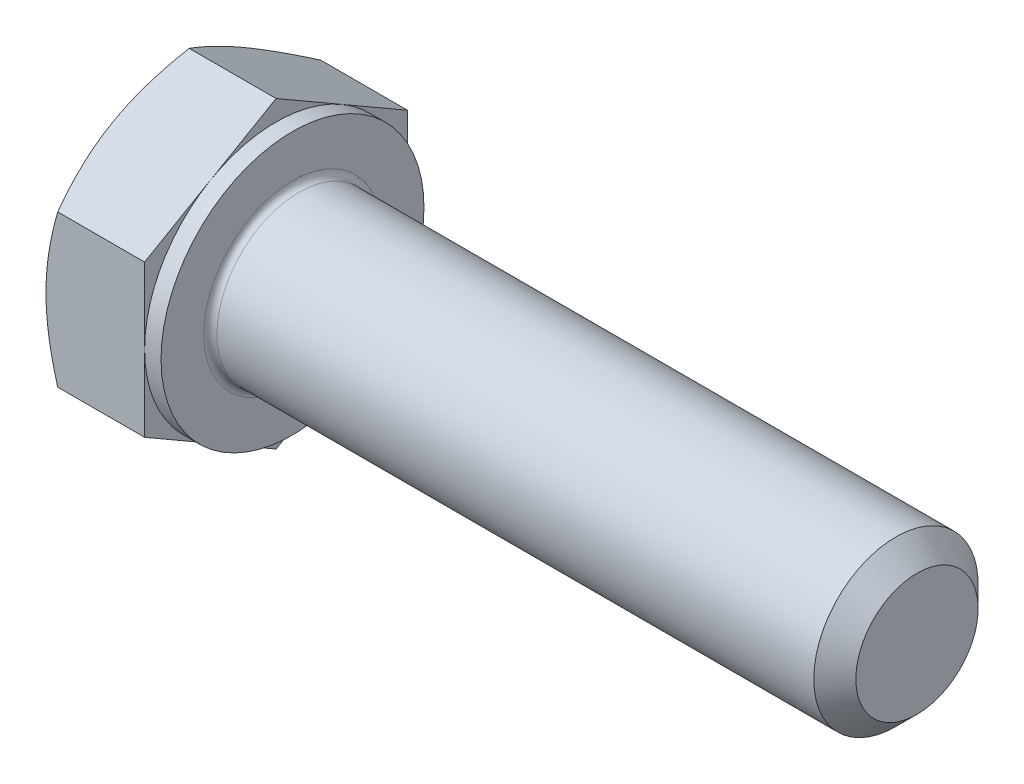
ISO-10303-21;
HEADER;
FILE_DESCRIPTION(('STEP AP214'),'2;1');
FILE_NAME('part.step','',(''),(''),'','','');
FILE_SCHEMA(('AUTOMOTIVE_DESIGN { 1 0 10303 214 1 1 1 1 }'));
ENDSEC;
DATA;
#1=APPLICATION_CONTEXT('core data for automotive mechanical design processes');
#2=APPLICATION_PROTOCOL_DEFINITION('international standard','automotive_design',2000,#1);
#3=PRODUCT_CONTEXT('',#1,'mechanical');
#4=PRODUCT('Part','Part','',(#3));
#5=PRODUCT_RELATED_PRODUCT_CATEGORY('part','',(#4));
#6=PRODUCT_DEFINITION_FORMATION('','',#4);
#7=PRODUCT_DEFINITION_CONTEXT('part definition',#1,'design');
#8=PRODUCT_DEFINITION('design','',#6,#7);
#9=PRODUCT_DEFINITION_SHAPE('','',#8);
#10=(LENGTH_UNIT() NAMED_UNIT(*) SI_UNIT(.MILLI.,.METRE.));
#11=(NAMED_UNIT(*) PLANE_ANGLE_UNIT() SI_UNIT($,.RADIAN.));
#12=(NAMED_UNIT(*) SI_UNIT($,.STERADIAN.) SOLID_ANGLE_UNIT());
#13=UNCERTAINTY_MEASURE_WITH_UNIT(LENGTH_MEASURE(1.E-05),#10,'distance_accuracy_value','');
#14=(GEOMETRIC_REPRESENTATION_CONTEXT(3) GLOBAL_UNCERTAINTY_ASSIGNED_CONTEXT((#13)) GLOBAL_UNIT_ASSIGNED_CONTEXT((#10,
#11,#12)) REPRESENTATION_CONTEXT('',''));
#15=CARTESIAN_POINT('',(0.,0.,0.));
#16=DIRECTION('',(0.,0.,1.));
#17=DIRECTION('',(1.,0.,0.));
#18=AXIS2_PLACEMENT_3D('',#15,#16,#17);
#19=CARTESIAN_POINT('',(3.5,2.3094010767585,-4.));
#20=DIRECTION('',(0.,-0.866025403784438,0.500000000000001));
#21=DIRECTION('',(0.,-0.500000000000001,-0.866025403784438));
#22=AXIS2_PLACEMENT_3D('',#19,#20,#21);
#23=PLANE('',#22);
#24=DIRECTION('',(0.,0.500000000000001,0.866025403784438));
#25=VECTOR('',#24,1.);
#26=CARTESIAN_POINT('',(3.,2.3094010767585,-4.));
#27=LINE('',#26,#25);
#28=CARTESIAN_POINT('',(3.,2.3094010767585,-4.));
#29=VERTEX_POINT('',#28);
#30=CARTESIAN_POINT('',(3.,3.46410161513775,-2.));
#31=VERTEX_POINT('',#30);
#32=EDGE_CURVE('E171',#29,#31,#27,.T.);
#33=ORIENTED_EDGE('',*,*,#32,.F.);
#34=DIRECTION('',(-1.,0.,0.));
#35=VECTOR('',#34,1.);
#36=CARTESIAN_POINT('',(3.5,2.3094010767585,-4.));
#37=LINE('',#36,#35);
#38=CARTESIAN_POINT('',(0.357265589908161,2.3094010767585,-4.));
#39=VERTEX_POINT('',#38);
#40=EDGE_CURVE('E299',#29,#39,#37,.T.);
#41=ORIENTED_EDGE('',*,*,#40,.T.);
#42=CARTESIAN_POINT('',(0.357332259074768,4.61891762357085,0.0002));
#43=CARTESIAN_POINT('',(0.298717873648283,4.51743148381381,-0.175579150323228));
#44=CARTESIAN_POINT('',(0.245410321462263,4.41506932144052,-0.35287561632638));
#45=CARTESIAN_POINT('',(0.152361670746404,4.2085725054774,-0.710538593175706));
#46=CARTESIAN_POINT('',(0.112653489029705,4.10443418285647,-0.890911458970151));
#47=CARTESIAN_POINT('',(0.05084221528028,3.89744813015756,-1.24942181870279));
#48=CARTESIAN_POINT('',(0.0283277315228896,3.7946322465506,-1.42750415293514));
#49=CARTESIAN_POINT('',(0.00145062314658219,3.58851671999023,-1.78450671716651));
#50=CARTESIAN_POINT('',(-0.0029342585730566,3.48521782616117,-1.9634256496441));
#51=CARTESIAN_POINT('',(0.00619007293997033,3.29219970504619,-2.29774284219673));
#52=CARTESIAN_POINT('',(0.0174589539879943,3.20245157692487,-2.45319115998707));
#53=CARTESIAN_POINT('',(0.053173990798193,3.02354002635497,-2.76307505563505));
#54=CARTESIAN_POINT('',(0.0776323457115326,2.93437722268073,-2.91750956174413));
#55=CARTESIAN_POINT('',(0.138776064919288,2.75509682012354,-3.22803232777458));
#56=CARTESIAN_POINT('',(0.175720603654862,2.6650019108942,-3.3840812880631));
#57=CARTESIAN_POINT('',(0.259570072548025,2.48615580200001,-3.69385183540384));
#58=CARTESIAN_POINT('',(0.306455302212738,2.39740231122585,-3.84757739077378));
#59=CARTESIAN_POINT('',(0.357332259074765,2.30928560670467,-4.0002));
#60=B_SPLINE_CURVE_WITH_KNOTS('',3,(#42,#43,#44,#45,#46,#47,#48,#49,#50,#51,#52,#53,#54,#55,#56,
#57,#58,#59),.UNSPECIFIED.,.F.,.F.,(4,2,2,2,2,2,2,2,4),(0.,0.634047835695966,1.26961969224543,
1.88946157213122,2.50854226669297,3.04757825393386,3.58711366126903,4.13861653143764,
4.68903648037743),.UNSPECIFIED.);
#61=CARTESIAN_POINT('',(0.,3.46410161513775,-2.));
#62=VERTEX_POINT('',#61);
#63=EDGE_CURVE('E226',#62,#39,#60,.T.);
#64=ORIENTED_EDGE('',*,*,#63,.F.);
#65=CARTESIAN_POINT('',(0.357265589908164,4.61880215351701,0.));
#66=VERTEX_POINT('',#65);
#67=EDGE_CURVE('E62',#66,#62,#60,.T.);
#68=ORIENTED_EDGE('',*,*,#67,.F.);
#69=DIRECTION('',(-1.,0.,0.));
#70=VECTOR('',#69,1.);
#71=CARTESIAN_POINT('',(3.5,4.61880215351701,0.));
#72=LINE('',#71,#70);
#73=CARTESIAN_POINT('',(3.,4.61880215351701,0.));
#74=VERTEX_POINT('',#73);
#75=EDGE_CURVE('E291',#74,#66,#72,.T.);
#76=ORIENTED_EDGE('',*,*,#75,.F.);
#77=EDGE_CURVE('E169',#31,#74,#27,.T.);
#78=ORIENTED_EDGE('',*,*,#77,.F.);
#79=EDGE_LOOP('',(#33,#41,#64,#68,#76,#78));
#80=FACE_BOUND('',#79,.T.);
#81=ADVANCED_FACE('F39',(#80),#23,.F.);
#82=CARTESIAN_POINT('',(3.5,4.61880215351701,0.));
#83=DIRECTION('',(0.,-0.866025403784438,-0.500000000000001));
#84=DIRECTION('',(0.,0.500000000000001,-0.866025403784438));
#85=AXIS2_PLACEMENT_3D('',#82,#83,#84);
#86=PLANE('',#85);
#87=DIRECTION('',(0.,-0.500000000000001,0.866025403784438));
#88=VECTOR('',#87,1.);
#89=CARTESIAN_POINT('',(3.,4.61880215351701,0.));
#90=LINE('',#89,#88);
#91=CARTESIAN_POINT('',(3.,3.46410161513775,2.));
#92=VERTEX_POINT('',#91);
#93=EDGE_CURVE('E168',#74,#92,#90,.T.);
#94=ORIENTED_EDGE('',*,*,#93,.F.);
#95=ORIENTED_EDGE('',*,*,#75,.T.);
#96=CARTESIAN_POINT('',(0.357332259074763,2.30928560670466,4.0002));
#97=CARTESIAN_POINT('',(0.298717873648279,2.4107717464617,3.82442084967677));
#98=CARTESIAN_POINT('',(0.24541032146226,2.51313390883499,3.64712438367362));
#99=CARTESIAN_POINT('',(0.152361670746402,2.71963072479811,3.28946140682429));
#100=CARTESIAN_POINT('',(0.112653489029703,2.82376904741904,3.10908854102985));
#101=CARTESIAN_POINT('',(0.0508422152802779,3.03075510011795,2.75057818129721));
#102=CARTESIAN_POINT('',(0.0283277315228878,3.13357098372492,2.57249584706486));
#103=CARTESIAN_POINT('',(0.00145062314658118,3.33968651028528,2.21549328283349));
#104=CARTESIAN_POINT('',(-0.00293425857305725,3.44298540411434,2.0365743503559));
#105=CARTESIAN_POINT('',(0.0061900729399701,3.63600352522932,1.70225715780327));
#106=CARTESIAN_POINT('',(0.0174589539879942,3.72575165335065,1.54680884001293));
#107=CARTESIAN_POINT('',(0.0531739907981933,3.90466320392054,1.23692494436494));
#108=CARTESIAN_POINT('',(0.0776323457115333,3.99382600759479,1.08249043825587));
#109=CARTESIAN_POINT('',(0.13877606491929,4.17310641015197,0.771967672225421));
#110=CARTESIAN_POINT('',(0.175720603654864,4.26320131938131,0.615918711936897));
#111=CARTESIAN_POINT('',(0.259570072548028,4.44204742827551,0.30614816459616));
#112=CARTESIAN_POINT('',(0.306455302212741,4.53080091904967,0.15242260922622));
#113=CARTESIAN_POINT('',(0.357332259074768,4.61891762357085,-0.000200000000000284));
#114=B_SPLINE_CURVE_WITH_KNOTS('',3,(#96,#97,#98,#99,#100,#101,#102,#103,#104,#105,#106,#107,
#108,#109,#110,#111,#112,#113),.UNSPECIFIED.,.F.,.F.,(4,2,2,2,2,2,2,2,4),(0.,0.634047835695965,
1.26961969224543,1.88946157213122,2.50854226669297,3.04757825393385,3.58711366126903,
4.13861653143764,4.68903648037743),.UNSPECIFIED.);
#115=CARTESIAN_POINT('',(0.,3.46410161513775,2.));
#116=VERTEX_POINT('',#115);
#117=EDGE_CURVE('E223',#116,#66,#114,.T.);
#118=ORIENTED_EDGE('',*,*,#117,.F.);
#119=CARTESIAN_POINT('',(0.35726558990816,2.3094010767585,4.));
#120=VERTEX_POINT('',#119);
#121=EDGE_CURVE('E237',#120,#116,#114,.T.);
#122=ORIENTED_EDGE('',*,*,#121,.F.);
#123=DIRECTION('',(-1.,0.,0.));
#124=VECTOR('',#123,1.);
#125=CARTESIAN_POINT('',(3.5,2.3094010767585,4.));
#126=LINE('',#125,#124);
#127=CARTESIAN_POINT('',(3.,2.3094010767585,4.));
#128=VERTEX_POINT('',#127);
#129=EDGE_CURVE('E293',#128,#120,#126,.T.);
#130=ORIENTED_EDGE('',*,*,#129,.F.);
#131=EDGE_CURVE('E136',#92,#128,#90,.T.);
#132=ORIENTED_EDGE('',*,*,#131,.F.);
#133=EDGE_LOOP('',(#94,#95,#118,#122,#130,#132));
#134=FACE_BOUND('',#133,.T.);
#135=ADVANCED_FACE('F244',(#134),#86,.F.);
#136=CARTESIAN_POINT('',(3.5,2.3094010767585,4.));
#137=DIRECTION('',(0.,0.,-1.));
#138=DIRECTION('',(0.,1.,0.));
#139=AXIS2_PLACEMENT_3D('',#136,#137,#138);
#140=PLANE('',#139);
#141=DIRECTION('',(0.,-1.,0.));
#142=VECTOR('',#141,1.);
#143=CARTESIAN_POINT('',(3.,2.3094010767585,4.));
#144=LINE('',#143,#142);
#145=CARTESIAN_POINT('',(3.,0.,4.));
#146=VERTEX_POINT('',#145);
#147=EDGE_CURVE('E130',#128,#146,#144,.T.);
#148=ORIENTED_EDGE('',*,*,#147,.F.);
#149=ORIENTED_EDGE('',*,*,#129,.T.);
#150=CARTESIAN_POINT('',(2.00011120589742,-6.30203842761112,4.));
#151=CARTESIAN_POINT('',(1.91454696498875,-6.12645846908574,4.));
#152=CARTESIAN_POINT('',(1.82977515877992,-5.95048585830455,4.));
#153=CARTESIAN_POINT('',(1.66226027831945,-5.59754684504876,4.));
#154=CARTESIAN_POINT('',(1.57951750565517,-5.42058029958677,4.));
#155=CARTESIAN_POINT('',(1.41610926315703,-5.06457985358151,4.));
#156=CARTESIAN_POINT('',(1.33545672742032,-4.88553999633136,4.));
#157=CARTESIAN_POINT('',(1.17732358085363,-4.52607013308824,4.));
#158=CARTESIAN_POINT('',(1.09984282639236,-4.34564019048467,4.));
#159=CARTESIAN_POINT('',(0.946328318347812,-3.97695712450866,4.));
#160=CARTESIAN_POINT('',(0.870432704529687,-3.7886461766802,4.));
#161=CARTESIAN_POINT('',(0.724150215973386,-3.40985798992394,4.));
#162=CARTESIAN_POINT('',(0.653763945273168,-3.21938051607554,4.));
#163=CARTESIAN_POINT('',(0.52027562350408,-2.83628177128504,4.));
#164=CARTESIAN_POINT('',(0.457159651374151,-2.64366539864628,4.));
#165=CARTESIAN_POINT('',(0.340171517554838,-2.25567134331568,4.));
#166=CARTESIAN_POINT('',(0.286296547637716,-2.06029451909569,4.));
#167=CARTESIAN_POINT('',(0.190596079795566,-1.66775019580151,4.));
#168=CARTESIAN_POINT('',(0.148703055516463,-1.47059946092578,4.));
#169=CARTESIAN_POINT('',(0.0792701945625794,-1.07374632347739,4.));
#170=CARTESIAN_POINT('',(0.0517287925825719,-0.874044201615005,4.));
#171=CARTESIAN_POINT('',(0.0135517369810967,-0.475733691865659,4.));
#172=CARTESIAN_POINT('',(0.00269106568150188,-0.277147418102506,4.));
#173=CARTESIAN_POINT('',(-0.0018027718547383,0.120241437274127,4.));
#174=CARTESIAN_POINT('',(0.00456430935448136,0.31904402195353,4.));
#175=CARTESIAN_POINT('',(0.029319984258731,0.653649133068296,4.));
#176=CARTESIAN_POINT('',(0.0433487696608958,0.789796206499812,4.));
#177=CARTESIAN_POINT('',(0.0786650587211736,1.0611517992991,4.));
#178=CARTESIAN_POINT('',(0.0999534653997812,1.1963601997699,4.));
#179=CARTESIAN_POINT('',(0.173595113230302,1.6003610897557,4.));
#180=CARTESIAN_POINT('',(0.235713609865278,1.86739658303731,4.));
#181=CARTESIAN_POINT('',(0.344187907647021,2.26690842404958,4.));
#182=CARTESIAN_POINT('',(0.383434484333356,2.40143348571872,4.));
#183=CARTESIAN_POINT('',(0.466191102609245,2.66917849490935,4.));
#184=CARTESIAN_POINT('',(0.509701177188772,2.8023984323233,4.));
#185=CARTESIAN_POINT('',(0.600271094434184,3.06757339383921,4.));
#186=CARTESIAN_POINT('',(0.647329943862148,3.19952876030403,4.));
#187=CARTESIAN_POINT('',(0.744425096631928,3.46233234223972,4.));
#188=CARTESIAN_POINT('',(0.794461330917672,3.5931805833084,4.));
#189=CARTESIAN_POINT('',(0.933355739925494,3.9462730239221,4.));
#190=CARTESIAN_POINT('',(1.0245987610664,4.16757823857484,4.));
#191=CARTESIAN_POINT('',(1.21247228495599,4.6078984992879,4.));
#192=CARTESIAN_POINT('',(1.30910339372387,4.82691328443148,4.));
#193=CARTESIAN_POINT('',(1.50647026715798,5.26317250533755,4.));
#194=CARTESIAN_POINT('',(1.60720747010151,5.48041628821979,4.));
#195=CARTESIAN_POINT('',(1.81181128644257,5.91342831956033,4.));
#196=CARTESIAN_POINT('',(1.91567799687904,6.12919652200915,3.99999999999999));
#197=CARTESIAN_POINT('',(2.12601769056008,6.55988022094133,3.99999999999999));
#198=CARTESIAN_POINT('',(2.23249454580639,6.77479382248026,3.99999999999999));
#199=CARTESIAN_POINT('',(2.44739203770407,7.20364803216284,3.99999999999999));
#200=CARTESIAN_POINT('',(2.55581269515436,7.41758862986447,3.99999999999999));
#201=CARTESIAN_POINT('',(2.88334503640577,8.05812603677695,3.99999999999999));
#202=CARTESIAN_POINT('',(3.10477549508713,8.48353660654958,3.99999999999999));
#203=CARTESIAN_POINT('',(3.52798949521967,9.28704830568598,3.99999999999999));
#204=CARTESIAN_POINT('',(3.72935795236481,9.66536913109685,3.99999999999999));
#205=CARTESIAN_POINT('',(4.13451859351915,10.4207405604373,3.99999999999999));
#206=CARTESIAN_POINT('',(4.33831092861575,10.7977910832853,3.99999999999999));
#207=CARTESIAN_POINT('',(4.74699525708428,11.5496417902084,3.99999999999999));
#208=CARTESIAN_POINT('',(4.95188119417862,11.9244452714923,3.99999999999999));
#209=CARTESIAN_POINT('',(5.36302659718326,12.6732594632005,3.99999999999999));
#210=CARTESIAN_POINT('',(5.56928595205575,13.0472702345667,3.99999999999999));
#211=CARTESIAN_POINT('',(5.7760450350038,13.42100281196,3.99999999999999));
#212=B_SPLINE_CURVE_WITH_KNOTS('',3,(#150,#151,#152,#153,#154,#155,#156,#157,#158,#159,#160,
#161,#162,#163,#164,#165,#166,#167,#168,#169,#170,#171,#172,#173,#174,#175,#176,#177,#178,#179,
#180,#181,#182,#183,#184,#185,#186,#187,#188,#189,#190,#191,#192,#193,#194,#195,#196,#197,#198,
#199,#200,#201,#202,#203,#204,#205,#206,#207,#208,#209,#210,#211),.UNSPECIFIED.,.F.,.F.,(4,2,2,
2,2,2,2,2,2,2,2,2,2,2,2,2,2,2,2,2,2,2,2,2,2,2,2,2,2,2,4),(0.,0.585964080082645,1.17201473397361,
1.76109183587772,2.35014223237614,2.95916537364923,3.56825519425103,4.17615863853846,
4.78387701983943,5.38809979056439,5.99225664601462,6.58818973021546,7.18413137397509,
7.59453803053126,8.00499575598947,8.82630884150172,9.24666973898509,9.66703388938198,
10.0872808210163,10.5075180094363,11.2255416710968,11.9436462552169,12.6620045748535,
13.3803851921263,14.0999050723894,14.8194326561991,16.2581595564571,17.5438734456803,
18.8296679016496,20.1111105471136,21.3924508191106),.UNSPECIFIED.);
#213=CARTESIAN_POINT('',(0.,0.,4.));
#214=VERTEX_POINT('',#213);
#215=EDGE_CURVE('E238',#214,#120,#212,.T.);
#216=ORIENTED_EDGE('',*,*,#215,.F.);
#217=CARTESIAN_POINT('',(0.357265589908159,-2.3094010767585,4.));
#218=VERTEX_POINT('',#217);
#219=EDGE_CURVE('E300',#218,#214,#212,.T.);
#220=ORIENTED_EDGE('',*,*,#219,.F.);
#221=DIRECTION('',(-1.,0.,0.));
#222=VECTOR('',#221,1.);
#223=CARTESIAN_POINT('',(3.5,-2.3094010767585,4.));
#224=LINE('',#223,#222);
#225=CARTESIAN_POINT('',(3.,-2.3094010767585,4.));
#226=VERTEX_POINT('',#225);
#227=EDGE_CURVE('E162',#226,#218,#224,.T.);
#228=ORIENTED_EDGE('',*,*,#227,.F.);
#229=EDGE_CURVE('E140',#146,#226,#144,.T.);
#230=ORIENTED_EDGE('',*,*,#229,.F.);
#231=EDGE_LOOP('',(#148,#149,#216,#220,#228,#230));
#232=FACE_BOUND('',#231,.T.);
#233=ADVANCED_FACE('F160',(#232),#140,.F.);
#234=CARTESIAN_POINT('',(3.5,-4.618802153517,0.));
#235=DIRECTION('',(0.,0.866025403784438,-0.500000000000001));
#236=DIRECTION('',(0.,0.500000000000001,0.866025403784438));
#237=AXIS2_PLACEMENT_3D('',#234,#235,#236);
#238=PLANE('',#237);
#239=DIRECTION('',(0.,-0.500000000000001,-0.866025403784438));
#240=VECTOR('',#239,1.);
#241=CARTESIAN_POINT('',(3.,-4.618802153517,0.));
#242=LINE('',#241,#240);
#243=CARTESIAN_POINT('',(3.,-3.46410161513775,2.));
#244=VERTEX_POINT('',#243);
#245=EDGE_CURVE('E147',#226,#244,#242,.T.);
#246=ORIENTED_EDGE('',*,*,#245,.F.);
#247=ORIENTED_EDGE('',*,*,#227,.T.);
#248=CARTESIAN_POINT('',(0.357332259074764,-4.61891762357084,-0.000199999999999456));
#249=CARTESIAN_POINT('',(0.29871787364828,-4.5174314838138,0.175579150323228));
#250=CARTESIAN_POINT('',(0.24541032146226,-4.41506932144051,0.352875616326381));
#251=CARTESIAN_POINT('',(0.152361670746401,-4.20857250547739,0.710538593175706));
#252=CARTESIAN_POINT('',(0.112653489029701,-4.10443418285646,0.890911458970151));
#253=CARTESIAN_POINT('',(0.0508422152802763,-3.89744813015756,1.24942181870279));
#254=CARTESIAN_POINT('',(0.0283277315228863,-3.79463224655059,1.42750415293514));
#255=CARTESIAN_POINT('',(0.00145062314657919,-3.58851671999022,1.78450671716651));
#256=CARTESIAN_POINT('',(-0.00293425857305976,-3.48521782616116,1.9634256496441));
#257=CARTESIAN_POINT('',(0.0061900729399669,-3.29219970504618,2.29774284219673));
#258=CARTESIAN_POINT('',(0.0174589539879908,-3.20245157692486,2.45319115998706));
#259=CARTESIAN_POINT('',(0.0531739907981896,-3.02354002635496,2.76307505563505));
#260=CARTESIAN_POINT('',(0.0776323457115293,-2.93437722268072,2.91750956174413));
#261=CARTESIAN_POINT('',(0.138776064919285,-2.75509682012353,3.22803232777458));
#262=CARTESIAN_POINT('',(0.17572060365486,-2.66500191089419,3.3840812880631));
#263=CARTESIAN_POINT('',(0.259570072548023,-2.486155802,3.69385183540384));
#264=CARTESIAN_POINT('',(0.306455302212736,-2.39740231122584,3.84757739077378));
#265=CARTESIAN_POINT('',(0.357332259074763,-2.30928560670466,4.0002));
#266=B_SPLINE_CURVE_WITH_KNOTS('',3,(#248,#249,#250,#251,#252,#253,#254,#255,#256,#257,#258,
#259,#260,#261,#262,#263,#264,#265),.UNSPECIFIED.,.F.,.F.,(4,2,2,2,2,2,2,2,4),(0.,
0.634047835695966,1.26961969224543,1.88946157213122,2.50854226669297,3.04757825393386,
3.58711366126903,4.13861653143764,4.68903648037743),.UNSPECIFIED.);
#267=CARTESIAN_POINT('',(0.,-3.46410161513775,2.));
#268=VERTEX_POINT('',#267);
#269=EDGE_CURVE('E225',#268,#218,#266,.T.);
#270=ORIENTED_EDGE('',*,*,#269,.F.);
#271=CARTESIAN_POINT('',(0.357265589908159,-4.618802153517,0.));
#272=VERTEX_POINT('',#271);
#273=EDGE_CURVE('E217',#272,#268,#266,.T.);
#274=ORIENTED_EDGE('',*,*,#273,.F.);
#275=DIRECTION('',(-1.,0.,0.));
#276=VECTOR('',#275,1.);
#277=CARTESIAN_POINT('',(3.5,-4.618802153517,0.));
#278=LINE('',#277,#276);
#279=CARTESIAN_POINT('',(3.,-4.618802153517,0.));
#280=VERTEX_POINT('',#279);
#281=EDGE_CURVE('E296',#280,#272,#278,.T.);
#282=ORIENTED_EDGE('',*,*,#281,.F.);
#283=EDGE_CURVE('E163',#244,#280,#242,.T.);
#284=ORIENTED_EDGE('',*,*,#283,.F.);
#285=EDGE_LOOP('',(#246,#247,#270,#274,#282,#284));
#286=FACE_BOUND('',#285,.T.);
#287=ADVANCED_FACE('F208',(#286),#238,.F.);
#288=CARTESIAN_POINT('',(3.5,-2.3094010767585,-4.));
#289=DIRECTION('',(0.,0.866025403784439,0.5));
#290=DIRECTION('',(0.,-0.5,0.866025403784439));
#291=AXIS2_PLACEMENT_3D('',#288,#289,#290);
#292=PLANE('',#291);
#293=DIRECTION('',(0.,0.5,-0.866025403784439));
#294=VECTOR('',#293,1.);
#295=CARTESIAN_POINT('',(3.,-2.3094010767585,-4.));
#296=LINE('',#295,#294);
#297=CARTESIAN_POINT('',(3.,-3.46410161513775,-2.));
#298=VERTEX_POINT('',#297);
#299=EDGE_CURVE('E346',#280,#298,#296,.T.);
#300=ORIENTED_EDGE('',*,*,#299,.F.);
#301=ORIENTED_EDGE('',*,*,#281,.T.);
#302=CARTESIAN_POINT('',(0.357332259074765,-2.30928560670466,-4.0002));
#303=CARTESIAN_POINT('',(0.298717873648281,-2.4107717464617,-3.82442084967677));
#304=CARTESIAN_POINT('',(0.245410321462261,-2.51313390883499,-3.64712438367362));
#305=CARTESIAN_POINT('',(0.152361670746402,-2.71963072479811,-3.28946140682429));
#306=CARTESIAN_POINT('',(0.112653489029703,-2.82376904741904,-3.10908854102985));
#307=CARTESIAN_POINT('',(0.0508422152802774,-3.03075510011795,-2.75057818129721));
#308=CARTESIAN_POINT('',(0.028327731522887,-3.13357098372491,-2.57249584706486));
#309=CARTESIAN_POINT('',(0.00145062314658,-3.33968651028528,-2.21549328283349));
#310=CARTESIAN_POINT('',(-0.00293425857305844,-3.44298540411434,-2.0365743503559));
#311=CARTESIAN_POINT('',(0.00619007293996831,-3.63600352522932,-1.70225715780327));
#312=CARTESIAN_POINT('',(0.0174589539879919,-3.72575165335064,-1.54680884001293));
#313=CARTESIAN_POINT('',(0.0531739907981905,-3.90466320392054,-1.23692494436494));
#314=CARTESIAN_POINT('',(0.0776323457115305,-3.99382600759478,-1.08249043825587));
#315=CARTESIAN_POINT('',(0.138776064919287,-4.17310641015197,-0.771967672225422));
#316=CARTESIAN_POINT('',(0.17572060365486,-4.26320131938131,-0.615918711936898));
#317=CARTESIAN_POINT('',(0.259570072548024,-4.4420474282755,-0.306148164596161));
#318=CARTESIAN_POINT('',(0.306455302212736,-4.53080091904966,-0.152422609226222));
#319=CARTESIAN_POINT('',(0.357332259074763,-4.61891762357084,0.000199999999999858));
#320=B_SPLINE_CURVE_WITH_KNOTS('',3,(#302,#303,#304,#305,#306,#307,#308,#309,#310,#311,#312,
#313,#314,#315,#316,#317,#318,#319),.UNSPECIFIED.,.F.,.F.,(4,2,2,2,2,2,2,2,4),(0.,
0.634047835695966,1.26961969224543,1.88946157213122,2.50854226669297,3.04757825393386,
3.58711366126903,4.13861653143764,4.68903648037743),.UNSPECIFIED.);
#321=CARTESIAN_POINT('',(0.,-3.46410161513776,-2.));
#322=VERTEX_POINT('',#321);
#323=EDGE_CURVE('E224',#322,#272,#320,.T.);
#324=ORIENTED_EDGE('',*,*,#323,.F.);
#325=CARTESIAN_POINT('',(0.357265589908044,-2.30940107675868,-4.));
#326=VERTEX_POINT('',#325);
#327=EDGE_CURVE('E185',#326,#322,#320,.T.);
#328=ORIENTED_EDGE('',*,*,#327,.F.);
#329=DIRECTION('',(-1.,0.,0.));
#330=VECTOR('',#329,1.);
#331=CARTESIAN_POINT('',(3.5,-2.3094010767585,-4.));
#332=LINE('',#331,#330);
#333=CARTESIAN_POINT('',(3.,-2.3094010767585,-4.));
#334=VERTEX_POINT('',#333);
#335=EDGE_CURVE('E298',#334,#326,#332,.T.);
#336=ORIENTED_EDGE('',*,*,#335,.F.);
#337=EDGE_CURVE('E158',#298,#334,#296,.T.);
#338=ORIENTED_EDGE('',*,*,#337,.F.);
#339=EDGE_LOOP('',(#300,#301,#324,#328,#336,#338));
#340=FACE_BOUND('',#339,.T.);
#341=ADVANCED_FACE('F201',(#340),#292,.F.);
#342=CARTESIAN_POINT('',(3.5,2.3094010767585,-4.));
#343=DIRECTION('',(0.,0.,1.));
#344=DIRECTION('',(0.,-1.,0.));
#345=AXIS2_PLACEMENT_3D('',#342,#343,#344);
#346=PLANE('',#345);
#347=DIRECTION('',(0.,1.,0.));
#348=VECTOR('',#347,1.);
#349=CARTESIAN_POINT('',(3.,2.3094010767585,-4.));
#350=LINE('',#349,#348);
#351=CARTESIAN_POINT('',(3.,0.,-4.));
#352=VERTEX_POINT('',#351);
#353=EDGE_CURVE('E270',#334,#352,#350,.T.);
#354=ORIENTED_EDGE('',*,*,#353,.F.);
#355=ORIENTED_EDGE('',*,*,#335,.T.);
#356=CARTESIAN_POINT('',(2.00011120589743,-6.30203842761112,-4.));
#357=CARTESIAN_POINT('',(1.91454696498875,-6.12645846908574,-4.));
#358=CARTESIAN_POINT('',(1.82977515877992,-5.95048585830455,-4.));
#359=CARTESIAN_POINT('',(1.66226027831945,-5.59754684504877,-4.));
#360=CARTESIAN_POINT('',(1.57951750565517,-5.42058029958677,-4.));
#361=CARTESIAN_POINT('',(1.41610926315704,-5.06457985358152,-4.));
#362=CARTESIAN_POINT('',(1.33545672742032,-4.88553999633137,-4.));
#363=CARTESIAN_POINT('',(1.17732358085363,-4.52607013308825,-4.));
#364=CARTESIAN_POINT('',(1.09984282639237,-4.34564019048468,-4.));
#365=CARTESIAN_POINT('',(0.946328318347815,-3.97695712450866,-4.));
#366=CARTESIAN_POINT('',(0.87043270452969,-3.78864617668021,-4.));
#367=CARTESIAN_POINT('',(0.724150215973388,-3.40985798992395,-4.));
#368=CARTESIAN_POINT('',(0.65376394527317,-3.21938051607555,-4.));
#369=CARTESIAN_POINT('',(0.520275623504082,-2.83628177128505,-4.));
#370=CARTESIAN_POINT('',(0.457159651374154,-2.64366539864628,-4.));
#371=CARTESIAN_POINT('',(0.34017151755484,-2.25567134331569,-4.));
#372=CARTESIAN_POINT('',(0.286296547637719,-2.0602945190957,-4.));
#373=CARTESIAN_POINT('',(0.190596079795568,-1.66775019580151,-4.));
#374=CARTESIAN_POINT('',(0.148703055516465,-1.47059946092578,-4.));
#375=CARTESIAN_POINT('',(0.0792701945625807,-1.07374632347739,-4.));
#376=CARTESIAN_POINT('',(0.051728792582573,-0.874044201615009,-4.));
#377=CARTESIAN_POINT('',(0.0135517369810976,-0.475733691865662,-4.));
#378=CARTESIAN_POINT('',(0.0026910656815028,-0.277147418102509,-4.));
#379=CARTESIAN_POINT('',(-0.0018027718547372,0.120241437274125,-4.));
#380=CARTESIAN_POINT('',(0.00456430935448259,0.319044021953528,-4.));
#381=CARTESIAN_POINT('',(0.0293199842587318,0.653649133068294,-4.));
#382=CARTESIAN_POINT('',(0.0433487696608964,0.78979620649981,-4.));
#383=CARTESIAN_POINT('',(0.078665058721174,1.06115179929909,-4.));
#384=CARTESIAN_POINT('',(0.0999534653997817,1.19636019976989,-4.));
#385=CARTESIAN_POINT('',(0.173595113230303,1.6003610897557,-4.));
#386=CARTESIAN_POINT('',(0.235713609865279,1.86739658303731,-4.));
#387=CARTESIAN_POINT('',(0.344187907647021,2.26690842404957,-4.));
#388=CARTESIAN_POINT('',(0.383434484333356,2.40143348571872,-4.));
#389=CARTESIAN_POINT('',(0.466191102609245,2.66917849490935,-4.));
#390=CARTESIAN_POINT('',(0.509701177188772,2.8023984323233,-4.));
#391=CARTESIAN_POINT('',(0.600271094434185,3.06757339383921,-4.));
#392=CARTESIAN_POINT('',(0.647329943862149,3.19952876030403,-4.));
#393=CARTESIAN_POINT('',(0.744425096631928,3.46233234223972,-4.));
#394=CARTESIAN_POINT('',(0.794461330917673,3.5931805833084,-4.));
#395=CARTESIAN_POINT('',(0.933355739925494,3.9462730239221,-4.));
#396=CARTESIAN_POINT('',(1.0245987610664,4.16757823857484,-4.));
#397=CARTESIAN_POINT('',(1.21247228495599,4.6078984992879,-4.));
#398=CARTESIAN_POINT('',(1.30910339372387,4.82691328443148,-4.));
#399=CARTESIAN_POINT('',(1.50647026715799,5.26317250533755,-4.));
#400=CARTESIAN_POINT('',(1.60720747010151,5.48041628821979,-4.));
#401=CARTESIAN_POINT('',(1.81181128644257,5.91342831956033,-4.));
#402=CARTESIAN_POINT('',(1.91567799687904,6.12919652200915,-4.));
#403=CARTESIAN_POINT('',(2.12601769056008,6.55988022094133,-4.));
#404=CARTESIAN_POINT('',(2.23249454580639,6.77479382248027,-4.));
#405=CARTESIAN_POINT('',(2.44739203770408,7.20364803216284,-4.));
#406=CARTESIAN_POINT('',(2.55581269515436,7.41758862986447,-4.));
#407=CARTESIAN_POINT('',(2.88334503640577,8.05812603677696,-4.));
#408=CARTESIAN_POINT('',(3.10477549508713,8.48353660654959,-4.));
#409=CARTESIAN_POINT('',(3.52798949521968,9.28704830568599,-4.));
#410=CARTESIAN_POINT('',(3.72935795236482,9.66536913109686,-4.));
#411=CARTESIAN_POINT('',(4.13451859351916,10.4207405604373,-4.));
#412=CARTESIAN_POINT('',(4.33831092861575,10.7977910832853,-3.99999999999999));
#413=CARTESIAN_POINT('',(4.74699525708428,11.5496417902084,-3.99999999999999));
#414=CARTESIAN_POINT('',(4.95188119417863,11.9244452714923,-3.99999999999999));
#415=CARTESIAN_POINT('',(5.36302659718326,12.6732594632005,-3.99999999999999));
#416=CARTESIAN_POINT('',(5.56928595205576,13.0472702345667,-3.99999999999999));
#417=CARTESIAN_POINT('',(5.7760450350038,13.42100281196,-3.99999999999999));
#418=B_SPLINE_CURVE_WITH_KNOTS('',3,(#356,#357,#358,#359,#360,#361,#362,#363,#364,#365,#366,
#367,#368,#369,#370,#371,#372,#373,#374,#375,#376,#377,#378,#379,#380,#381,#382,#383,#384,#385,
#386,#387,#388,#389,#390,#391,#392,#393,#394,#395,#396,#397,#398,#399,#400,#401,#402,#403,#404,
#405,#406,#407,#408,#409,#410,#411,#412,#413,#414,#415,#416,#417),.UNSPECIFIED.,.F.,.F.,(4,2,2,
2,2,2,2,2,2,2,2,2,2,2,2,2,2,2,2,2,2,2,2,2,2,2,2,2,2,2,4),(0.,0.585964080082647,1.17201473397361,
1.76109183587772,2.35014223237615,2.95916537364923,3.56825519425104,4.17615863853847,
4.78387701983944,5.38809979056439,5.99225664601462,6.58818973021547,7.1841313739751,
7.59453803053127,8.00499575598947,8.82630884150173,9.2466697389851,9.66703388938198,
10.0872808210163,10.5075180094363,11.2255416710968,11.9436462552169,12.6620045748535,
13.3803851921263,14.0999050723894,14.8194326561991,16.2581595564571,17.5438734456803,
18.8296679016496,20.1111105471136,21.3924508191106),.UNSPECIFIED.);
#419=CARTESIAN_POINT('',(0.,0.,-4.));
#420=VERTEX_POINT('',#419);
#421=EDGE_CURVE('E175',#420,#326,#418,.F.);
#422=ORIENTED_EDGE('',*,*,#421,.F.);
#423=EDGE_CURVE('E184',#39,#420,#418,.F.);
#424=ORIENTED_EDGE('',*,*,#423,.F.);
#425=ORIENTED_EDGE('',*,*,#40,.F.);
#426=EDGE_CURVE('E274',#352,#29,#350,.T.);
#427=ORIENTED_EDGE('',*,*,#426,.F.);
#428=EDGE_LOOP('',(#354,#355,#422,#424,#425,#427));
#429=FACE_BOUND('',#428,.T.);
#430=ADVANCED_FACE('F196',(#429),#346,.F.);
#431=CARTESIAN_POINT('',(0.,0.,0.));
#432=DIRECTION('',(1.,0.,0.));
#433=DIRECTION('',(0.,0.,-1.));
#434=AXIS2_PLACEMENT_3D('',#431,#432,#433);
#435=CONICAL_SURFACE('',#434,4.,1.0471975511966);
#436=ORIENTED_EDGE('',*,*,#327,.T.);
#437=CARTESIAN_POINT('',(0.,0.,0.));
#438=DIRECTION('',(1.,0.,0.));
#439=DIRECTION('',(0.,0.,-1.));
#440=AXIS2_PLACEMENT_3D('',#437,#438,#439);
#441=CIRCLE('',#440,4.);
#442=EDGE_CURVE('E287',#322,#420,#441,.T.);
#443=ORIENTED_EDGE('',*,*,#442,.T.);
#444=ORIENTED_EDGE('',*,*,#421,.T.);
#445=EDGE_LOOP('',(#436,#443,#444));
#446=FACE_BOUND('',#445,.T.);
#447=ADVANCED_FACE('F200',(#446),#435,.T.);
#448=ORIENTED_EDGE('',*,*,#273,.T.);
#449=EDGE_CURVE('E290',#268,#322,#441,.T.);
#450=ORIENTED_EDGE('',*,*,#449,.T.);
#451=ORIENTED_EDGE('',*,*,#323,.T.);
#452=EDGE_LOOP('',(#448,#450,#451));
#453=FACE_BOUND('',#452,.T.);
#454=ADVANCED_FACE('F343',(#453),#435,.T.);
#455=ORIENTED_EDGE('',*,*,#219,.T.);
#456=EDGE_CURVE('E320',#214,#268,#441,.T.);
#457=ORIENTED_EDGE('',*,*,#456,.T.);
#458=ORIENTED_EDGE('',*,*,#269,.T.);
#459=EDGE_LOOP('',(#455,#457,#458));
#460=FACE_BOUND('',#459,.T.);
#461=ADVANCED_FACE('F192',(#460),#435,.T.);
#462=ORIENTED_EDGE('',*,*,#215,.T.);
#463=ORIENTED_EDGE('',*,*,#121,.T.);
#464=CARTESIAN_POINT('',(0.,0.,0.));
#465=DIRECTION('',(-1.,0.,0.));
#466=DIRECTION('',(0.,0.,1.));
#467=AXIS2_PLACEMENT_3D('',#464,#465,#466);
#468=CIRCLE('',#467,4.);
#469=EDGE_CURVE('E172',#214,#116,#468,.T.);
#470=ORIENTED_EDGE('',*,*,#469,.F.);
#471=EDGE_LOOP('',(#462,#463,#470));
#472=FACE_BOUND('',#471,.T.);
#473=ADVANCED_FACE('F314',(#472),#435,.T.);
#474=ORIENTED_EDGE('',*,*,#117,.T.);
#475=ORIENTED_EDGE('',*,*,#67,.T.);
#476=EDGE_CURVE('E285',#62,#116,#441,.T.);
#477=ORIENTED_EDGE('',*,*,#476,.T.);
#478=EDGE_LOOP('',(#474,#475,#477));
#479=FACE_BOUND('',#478,.T.);
#480=ADVANCED_FACE('F318',(#479),#435,.T.);
#481=ORIENTED_EDGE('',*,*,#63,.T.);
#482=ORIENTED_EDGE('',*,*,#423,.T.);
#483=EDGE_CURVE('E284',#420,#62,#441,.T.);
#484=ORIENTED_EDGE('',*,*,#483,.T.);
#485=EDGE_LOOP('',(#481,#482,#484));
#486=FACE_BOUND('',#485,.T.);
#487=ADVANCED_FACE('F334',(#486),#435,.T.);
#488=CARTESIAN_POINT('',(0.,4.61880215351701,0.));
#489=DIRECTION('',(1.,0.,0.));
#490=DIRECTION('',(0.,0.,-1.));
#491=AXIS2_PLACEMENT_3D('',#488,#489,#490);
#492=PLANE('',#491);
#493=ORIENTED_EDGE('',*,*,#483,.F.);
#494=ORIENTED_EDGE('',*,*,#442,.F.);
#495=ORIENTED_EDGE('',*,*,#449,.F.);
#496=ORIENTED_EDGE('',*,*,#456,.F.);
#497=ORIENTED_EDGE('',*,*,#469,.T.);
#498=ORIENTED_EDGE('',*,*,#476,.F.);
#499=EDGE_LOOP('',(#493,#494,#495,#496,#497,#498));
#500=FACE_BOUND('',#499,.T.);
#501=ADVANCED_FACE('F203',(#500),#492,.F.);
#502=CARTESIAN_POINT('',(3.,4.,0.));
#503=DIRECTION('',(1.,0.,0.));
#504=DIRECTION('',(0.,0.,-1.));
#505=AXIS2_PLACEMENT_3D('',#502,#503,#504);
#506=PLANE('',#505);
#507=ORIENTED_EDGE('',*,*,#32,.T.);
#508=CARTESIAN_POINT('',(3.,0.,0.));
#509=DIRECTION('',(-1.,0.,0.));
#510=DIRECTION('',(0.,0.,1.));
#511=AXIS2_PLACEMENT_3D('',#508,#509,#510);
#512=CIRCLE('',#511,4.);
#513=EDGE_CURVE('E54',#31,#352,#512,.T.);
#514=ORIENTED_EDGE('',*,*,#513,.T.);
#515=ORIENTED_EDGE('',*,*,#426,.T.);
#516=EDGE_LOOP('',(#507,#514,#515));
#517=FACE_BOUND('',#516,.T.);
#518=ADVANCED_FACE('F352',(#517),#506,.T.);
#519=ORIENTED_EDGE('',*,*,#77,.T.);
#520=ORIENTED_EDGE('',*,*,#93,.T.);
#521=EDGE_CURVE('E157',#92,#31,#512,.T.);
#522=ORIENTED_EDGE('',*,*,#521,.T.);
#523=EDGE_LOOP('',(#519,#520,#522));
#524=FACE_BOUND('',#523,.T.);
#525=ADVANCED_FACE('F354',(#524),#506,.T.);
#526=ORIENTED_EDGE('',*,*,#131,.T.);
#527=ORIENTED_EDGE('',*,*,#147,.T.);
#528=EDGE_CURVE('E134',#146,#92,#512,.T.);
#529=ORIENTED_EDGE('',*,*,#528,.T.);
#530=EDGE_LOOP('',(#526,#527,#529));
#531=FACE_BOUND('',#530,.T.);
#532=ADVANCED_FACE('F132',(#531),#506,.T.);
#533=ORIENTED_EDGE('',*,*,#229,.T.);
#534=ORIENTED_EDGE('',*,*,#245,.T.);
#535=EDGE_CURVE('E144',#244,#146,#512,.T.);
#536=ORIENTED_EDGE('',*,*,#535,.T.);
#537=EDGE_LOOP('',(#533,#534,#536));
#538=FACE_BOUND('',#537,.T.);
#539=ADVANCED_FACE('F145',(#538),#506,.T.);
#540=ORIENTED_EDGE('',*,*,#283,.T.);
#541=ORIENTED_EDGE('',*,*,#299,.T.);
#542=EDGE_CURVE('E151',#298,#244,#512,.T.);
#543=ORIENTED_EDGE('',*,*,#542,.T.);
#544=EDGE_LOOP('',(#540,#541,#543));
#545=FACE_BOUND('',#544,.T.);
#546=ADVANCED_FACE('F368',(#545),#506,.T.);
#547=ORIENTED_EDGE('',*,*,#337,.T.);
#548=ORIENTED_EDGE('',*,*,#353,.T.);
#549=EDGE_CURVE('E351',#352,#298,#512,.T.);
#550=ORIENTED_EDGE('',*,*,#549,.T.);
#551=EDGE_LOOP('',(#547,#548,#550));
#552=FACE_BOUND('',#551,.T.);
#553=ADVANCED_FACE('F349',(#552),#506,.T.);
#554=CARTESIAN_POINT('',(0.,0.,0.));
#555=DIRECTION('',(-1.,0.,0.));
#556=DIRECTION('',(0.,0.,1.));
#557=AXIS2_PLACEMENT_3D('',#554,#555,#556);
#558=CYLINDRICAL_SURFACE('',#557,4.);
#559=ORIENTED_EDGE('',*,*,#513,.F.);
#560=ORIENTED_EDGE('',*,*,#521,.F.);
#561=ORIENTED_EDGE('',*,*,#528,.F.);
#562=ORIENTED_EDGE('',*,*,#535,.F.);
#563=ORIENTED_EDGE('',*,*,#542,.F.);
#564=ORIENTED_EDGE('',*,*,#549,.F.);
#565=EDGE_LOOP('',(#559,#560,#561,#562,#563,#564));
#566=FACE_BOUND('',#565,.T.);
#567=CARTESIAN_POINT('',(3.5,0.,0.));
#568=DIRECTION('',(1.,0.,0.));
#569=DIRECTION('',(0.,0.,-1.));
#570=AXIS2_PLACEMENT_3D('',#567,#568,#569);
#571=CIRCLE('',#570,4.);
#572=CARTESIAN_POINT('',(3.5,0.,-4.));
#573=VERTEX_POINT('',#572);
#574=EDGE_CURVE('E283',#573,#573,#571,.T.);
#575=ORIENTED_EDGE('',*,*,#574,.F.);
#576=EDGE_LOOP('',(#575));
#577=FACE_BOUND('',#576,.T.);
#578=ADVANCED_FACE('F154',(#566,#577),#558,.T.);
#579=CARTESIAN_POINT('',(22.5,0.,0.));
#580=DIRECTION('',(-1.,0.,0.));
#581=DIRECTION('',(0.,0.,1.));
#582=AXIS2_PLACEMENT_3D('',#579,#580,#581);
#583=PLANE('',#582);
#584=CARTESIAN_POINT('',(22.5,0.,0.));
#585=DIRECTION('',(-1.,0.,0.));
#586=DIRECTION('',(0.,0.,1.));
#587=AXIS2_PLACEMENT_3D('',#584,#585,#586);
#588=CIRCLE('',#587,1.86);
#589=CARTESIAN_POINT('',(22.5,0.,1.86));
#590=VERTEX_POINT('',#589);
#591=EDGE_CURVE('E265',#590,#590,#588,.F.);
#592=ORIENTED_EDGE('',*,*,#591,.T.);
#593=EDGE_LOOP('',(#592));
#594=FACE_BOUND('',#593,.T.);
#595=ADVANCED_FACE('F362',(#594),#583,.F.);
#596=CARTESIAN_POINT('',(0.,0.,0.));
#597=DIRECTION('',(-1.,0.,0.));
#598=DIRECTION('',(0.,0.,1.));
#599=AXIS2_PLACEMENT_3D('',#596,#597,#598);
#600=CYLINDRICAL_SURFACE('',#599,2.5);
#601=CARTESIAN_POINT('',(3.7,0.,0.));
#602=DIRECTION('',(1.,0.,0.));
#603=DIRECTION('',(0.,0.,-1.));
#604=AXIS2_PLACEMENT_3D('',#601,#602,#603);
#605=CIRCLE('',#604,2.5);
#606=CARTESIAN_POINT('',(3.7,0.,-2.5));
#607=VERTEX_POINT('',#606);
#608=EDGE_CURVE('E12',#607,#607,#605,.T.);
#609=ORIENTED_EDGE('',*,*,#608,.T.);
#610=EDGE_LOOP('',(#609));
#611=FACE_BOUND('',#610,.T.);
#612=CARTESIAN_POINT('',(21.86,0.,0.));
#613=DIRECTION('',(-1.,0.,0.));
#614=DIRECTION('',(0.,0.,1.));
#615=AXIS2_PLACEMENT_3D('',#612,#613,#614);
#616=CIRCLE('',#615,2.5);
#617=CARTESIAN_POINT('',(21.86,0.,2.5));
#618=VERTEX_POINT('',#617);
#619=EDGE_CURVE('E268',#618,#618,#616,.T.);
#620=ORIENTED_EDGE('',*,*,#619,.T.);
#621=EDGE_LOOP('',(#620));
#622=FACE_BOUND('',#621,.T.);
#623=ADVANCED_FACE('F260',(#611,#622),#600,.T.);
#624=CARTESIAN_POINT('',(3.5,4.61880215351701,0.));
#625=DIRECTION('',(1.,0.,0.));
#626=DIRECTION('',(0.,0.,-1.));
#627=AXIS2_PLACEMENT_3D('',#624,#625,#626);
#628=PLANE('',#627);
#629=CARTESIAN_POINT('',(3.5,0.,0.));
#630=DIRECTION('',(1.,0.,0.));
#631=DIRECTION('',(0.,0.,-1.));
#632=AXIS2_PLACEMENT_3D('',#629,#630,#631);
#633=CIRCLE('',#632,2.7);
#634=CARTESIAN_POINT('',(3.5,0.,-2.7));
#635=VERTEX_POINT('',#634);
#636=EDGE_CURVE('E47',#635,#635,#633,.F.);
#637=ORIENTED_EDGE('',*,*,#636,.T.);
#638=EDGE_LOOP('',(#637));
#639=FACE_BOUND('',#638,.T.);
#640=ORIENTED_EDGE('',*,*,#574,.T.);
#641=EDGE_LOOP('',(#640));
#642=FACE_BOUND('',#641,.T.);
#643=ADVANCED_FACE('F253',(#639,#642),#628,.T.);
#644=CARTESIAN_POINT('',(21.86,0.,0.));
#645=DIRECTION('',(-1.,0.,0.));
#646=DIRECTION('',(0.,0.,1.));
#647=AXIS2_PLACEMENT_3D('',#644,#645,#646);
#648=CONICAL_SURFACE('',#647,2.5,0.785398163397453);
#649=ORIENTED_EDGE('',*,*,#591,.F.);
#650=EDGE_LOOP('',(#649));
#651=FACE_BOUND('',#650,.T.);
#652=ORIENTED_EDGE('',*,*,#619,.F.);
#653=EDGE_LOOP('',(#652));
#654=FACE_BOUND('',#653,.T.);
#655=ADVANCED_FACE('F251',(#651,#654),#648,.T.);
#656=CARTESIAN_POINT('',(3.7,0.,0.));
#657=DIRECTION('',(1.,0.,0.));
#658=DIRECTION('',(0.,0.,-1.));
#659=AXIS2_PLACEMENT_3D('',#656,#657,#658);
#660=TOROIDAL_SURFACE('',#659,2.7,0.2);
#661=ORIENTED_EDGE('',*,*,#608,.F.);
#662=EDGE_LOOP('',(#661));
#663=FACE_BOUND('',#662,.T.);
#664=ORIENTED_EDGE('',*,*,#636,.F.);
#665=EDGE_LOOP('',(#664));
#666=FACE_BOUND('',#665,.T.);
#667=ADVANCED_FACE('F41',(#663,#666),#660,.F.);
#668=CLOSED_SHELL('',(#81,#135,#233,#287,#341,#430,#447,#454,#461,#473,#480,#487,#501,#518,#525,
#532,#539,#546,#553,#578,#595,#623,#643,#655,#667));
#669=MANIFOLD_SOLID_BREP('B2',#668);
#670=ADVANCED_BREP_SHAPE_REPRESENTATION('',(#18,#669),#14);
#671=SHAPE_DEFINITION_REPRESENTATION(#9,#670);
ENDSEC;
END-ISO-10303-21;
